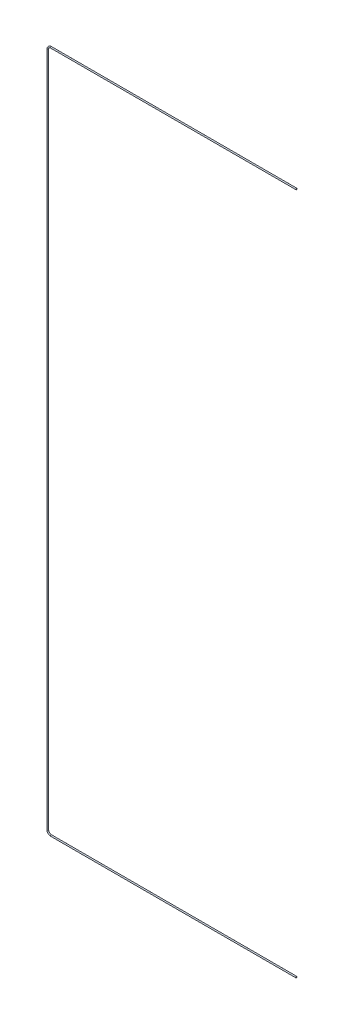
ISO-10303-21;
HEADER;
FILE_DESCRIPTION(('STEP AP214'),'2;1');
FILE_NAME('part.step','',(''),(''),'','','');
FILE_SCHEMA(('AUTOMOTIVE_DESIGN { 1 0 10303 214 1 1 1 1 }'));
ENDSEC;
DATA;
#1=APPLICATION_CONTEXT('core data for automotive mechanical design processes');
#2=APPLICATION_PROTOCOL_DEFINITION('international standard','automotive_design',2000,#1);
#3=PRODUCT_CONTEXT('',#1,'mechanical');
#4=PRODUCT('Part','Part','',(#3));
#5=PRODUCT_RELATED_PRODUCT_CATEGORY('part','',(#4));
#6=PRODUCT_DEFINITION_FORMATION('','',#4);
#7=PRODUCT_DEFINITION_CONTEXT('part definition',#1,'design');
#8=PRODUCT_DEFINITION('design','',#6,#7);
#9=PRODUCT_DEFINITION_SHAPE('','',#8);
#10=(LENGTH_UNIT() NAMED_UNIT(*) SI_UNIT(.MILLI.,.METRE.));
#11=(NAMED_UNIT(*) PLANE_ANGLE_UNIT() SI_UNIT($,.RADIAN.));
#12=(NAMED_UNIT(*) SI_UNIT($,.STERADIAN.) SOLID_ANGLE_UNIT());
#13=UNCERTAINTY_MEASURE_WITH_UNIT(LENGTH_MEASURE(1.E-05),#10,'distance_accuracy_value','');
#14=(GEOMETRIC_REPRESENTATION_CONTEXT(3) GLOBAL_UNCERTAINTY_ASSIGNED_CONTEXT((#13)) GLOBAL_UNIT_ASSIGNED_CONTEXT((#10,
#11,#12)) REPRESENTATION_CONTEXT('',''));
#15=CARTESIAN_POINT('',(0.,0.,0.));
#16=DIRECTION('',(0.,0.,1.));
#17=DIRECTION('',(1.,0.,0.));
#18=AXIS2_PLACEMENT_3D('',#15,#16,#17);
#19=CARTESIAN_POINT('',(0.,-1.02616,0.));
#20=DIRECTION('',(1.,0.,0.));
#21=DIRECTION('',(0.,0.,-1.));
#22=AXIS2_PLACEMENT_3D('',#19,#20,#21);
#23=PLANE('',#22);
#24=CARTESIAN_POINT('',(0.,-1.02616,0.));
#25=DIRECTION('',(1.,0.,0.));
#26=DIRECTION('',(0.,0.,-1.));
#27=AXIS2_PLACEMENT_3D('',#24,#25,#26);
#28=CIRCLE('',#27,1.02616);
#29=CARTESIAN_POINT('',(0.,-1.02616,-1.02616));
#30=VERTEX_POINT('',#29);
#31=EDGE_CURVE('E44',#30,#30,#28,.T.);
#32=ORIENTED_EDGE('',*,*,#31,.T.);
#33=EDGE_LOOP('',(#32));
#34=FACE_BOUND('',#33,.T.);
#35=ADVANCED_FACE('F32',(#34),#23,.T.);
#36=CARTESIAN_POINT('',(-1.11022302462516E-13,-1113.77984,0.));
#37=DIRECTION('',(-1.,0.,0.));
#38=DIRECTION('',(0.,0.,-1.));
#39=AXIS2_PLACEMENT_3D('',#36,#37,#38);
#40=PLANE('',#39);
#41=CARTESIAN_POINT('',(-1.11022302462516E-13,-1113.77984,0.));
#42=DIRECTION('',(-1.,0.,0.));
#43=DIRECTION('',(0.,0.,-1.));
#44=AXIS2_PLACEMENT_3D('',#41,#42,#43);
#45=CIRCLE('',#44,1.02616);
#46=CARTESIAN_POINT('',(-1.11022302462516E-13,-1113.77984,-1.02616));
#47=VERTEX_POINT('',#46);
#48=EDGE_CURVE('E11',#47,#47,#45,.T.);
#49=ORIENTED_EDGE('',*,*,#48,.F.);
#50=EDGE_LOOP('',(#49));
#51=FACE_BOUND('',#50,.T.);
#52=ADVANCED_FACE('F50',(#51),#40,.F.);
#53=CARTESIAN_POINT('',(0.,-1.02616,0.));
#54=DIRECTION('',(-1.,0.,0.));
#55=DIRECTION('',(0.,0.,1.));
#56=AXIS2_PLACEMENT_3D('',#53,#54,#55);
#57=CYLINDRICAL_SURFACE('',#56,1.02616);
#58=CARTESIAN_POINT('',(-400.05,-1.02616,0.));
#59=DIRECTION('',(1.,0.,0.));
#60=DIRECTION('',(0.,0.,-1.));
#61=AXIS2_PLACEMENT_3D('',#58,#59,#60);
#62=CIRCLE('',#61,1.02616);
#63=CARTESIAN_POINT('',(-400.05,0.,0.));
#64=VERTEX_POINT('',#63);
#65=EDGE_CURVE('E84',#64,#64,#62,.T.);
#66=ORIENTED_EDGE('',*,*,#65,.T.);
#67=EDGE_LOOP('',(#66));
#68=FACE_BOUND('',#67,.T.);
#69=ORIENTED_EDGE('',*,*,#31,.F.);
#70=EDGE_LOOP('',(#69));
#71=FACE_BOUND('',#70,.T.);
#72=ADVANCED_FACE('F52',(#68,#71),#57,.T.);
#73=CARTESIAN_POINT('',(-400.05,-6.35,0.));
#74=DIRECTION('',(0.,0.,1.));
#75=DIRECTION('',(1.,0.,0.));
#76=AXIS2_PLACEMENT_3D('',#73,#74,#75);
#77=TOROIDAL_SURFACE('',#76,5.32384000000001,1.02616);
#78=CARTESIAN_POINT('',(-405.37384,-6.35,0.));
#79=DIRECTION('',(0.,1.,0.));
#80=DIRECTION('',(0.,0.,-1.));
#81=AXIS2_PLACEMENT_3D('',#78,#79,#80);
#82=CIRCLE('',#81,1.02616);
#83=CARTESIAN_POINT('',(-406.4,-6.35,0.));
#84=VERTEX_POINT('',#83);
#85=EDGE_CURVE('E81',#84,#84,#82,.T.);
#86=CARTESIAN_POINT('',(-400.05,-6.35,0.));
#87=DIRECTION('',(0.,0.,1.));
#88=DIRECTION('',(1.,0.,0.));
#89=AXIS2_PLACEMENT_3D('',#86,#87,#88);
#90=CIRCLE('',#89,6.35000000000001);
#91=EDGE_CURVE('',#64,#84,#90,.T.);
#92=ORIENTED_EDGE('',*,*,#65,.F.);
#93=ORIENTED_EDGE('',*,*,#85,.T.);
#94=ORIENTED_EDGE('',*,*,#91,.T.);
#95=ORIENTED_EDGE('',*,*,#91,.F.);
#96=EDGE_LOOP('',(#92,#94,#93,#95));
#97=FACE_BOUND('',#96,.T.);
#98=ADVANCED_FACE('F57',(#97),#77,.T.);
#99=CARTESIAN_POINT('',(-405.37384,-6.35,0.));
#100=DIRECTION('',(0.,-1.,0.));
#101=DIRECTION('',(0.,0.,-1.));
#102=AXIS2_PLACEMENT_3D('',#99,#100,#101);
#103=CYLINDRICAL_SURFACE('',#102,1.02616);
#104=CARTESIAN_POINT('',(-405.37384,-1108.456,0.));
#105=DIRECTION('',(0.,1.,0.));
#106=DIRECTION('',(0.,0.,-1.));
#107=AXIS2_PLACEMENT_3D('',#104,#105,#106);
#108=CIRCLE('',#107,1.02616);
#109=CARTESIAN_POINT('',(-406.4,-1108.456,0.));
#110=VERTEX_POINT('',#109);
#111=EDGE_CURVE('E86',#110,#110,#108,.T.);
#112=ORIENTED_EDGE('',*,*,#111,.T.);
#113=EDGE_LOOP('',(#112));
#114=FACE_BOUND('',#113,.T.);
#115=ORIENTED_EDGE('',*,*,#85,.F.);
#116=EDGE_LOOP('',(#115));
#117=FACE_BOUND('',#116,.T.);
#118=ADVANCED_FACE('F67',(#114,#117),#103,.T.);
#119=CARTESIAN_POINT('',(-400.05,-1108.456,0.));
#120=DIRECTION('',(0.,0.,1.));
#121=DIRECTION('',(1.,0.,0.));
#122=AXIS2_PLACEMENT_3D('',#119,#120,#121);
#123=TOROIDAL_SURFACE('',#122,5.32384000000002,1.02616);
#124=CARTESIAN_POINT('',(-400.05,-1113.77984,0.));
#125=DIRECTION('',(-1.,0.,0.));
#126=DIRECTION('',(0.,0.,-1.));
#127=AXIS2_PLACEMENT_3D('',#124,#125,#126);
#128=CIRCLE('',#127,1.02616);
#129=CARTESIAN_POINT('',(-400.05,-1114.806,0.));
#130=VERTEX_POINT('',#129);
#131=EDGE_CURVE('E39',#130,#130,#128,.T.);
#132=CARTESIAN_POINT('',(-400.05,-1108.456,0.));
#133=DIRECTION('',(0.,0.,1.));
#134=DIRECTION('',(1.,0.,0.));
#135=AXIS2_PLACEMENT_3D('',#132,#133,#134);
#136=CIRCLE('',#135,6.35000000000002);
#137=EDGE_CURVE('',#110,#130,#136,.T.);
#138=ORIENTED_EDGE('',*,*,#111,.F.);
#139=ORIENTED_EDGE('',*,*,#131,.T.);
#140=ORIENTED_EDGE('',*,*,#137,.T.);
#141=ORIENTED_EDGE('',*,*,#137,.F.);
#142=EDGE_LOOP('',(#138,#140,#139,#141));
#143=FACE_BOUND('',#142,.T.);
#144=ADVANCED_FACE('F63',(#143),#123,.T.);
#145=CARTESIAN_POINT('',(-400.05,-1113.77984,0.));
#146=DIRECTION('',(1.,0.,0.));
#147=DIRECTION('',(0.,0.,-1.));
#148=AXIS2_PLACEMENT_3D('',#145,#146,#147);
#149=CYLINDRICAL_SURFACE('',#148,1.02616);
#150=ORIENTED_EDGE('',*,*,#48,.T.);
#151=EDGE_LOOP('',(#150));
#152=FACE_BOUND('',#151,.T.);
#153=ORIENTED_EDGE('',*,*,#131,.F.);
#154=EDGE_LOOP('',(#153));
#155=FACE_BOUND('',#154,.T.);
#156=ADVANCED_FACE('F47',(#152,#155),#149,.T.);
#157=CLOSED_SHELL('',(#35,#52,#72,#98,#118,#144,#156));
#158=MANIFOLD_SOLID_BREP('B2',#157);
#159=ADVANCED_BREP_SHAPE_REPRESENTATION('',(#18,#158),#14);
#160=SHAPE_DEFINITION_REPRESENTATION(#9,#159);
ENDSEC;
END-ISO-10303-21;
